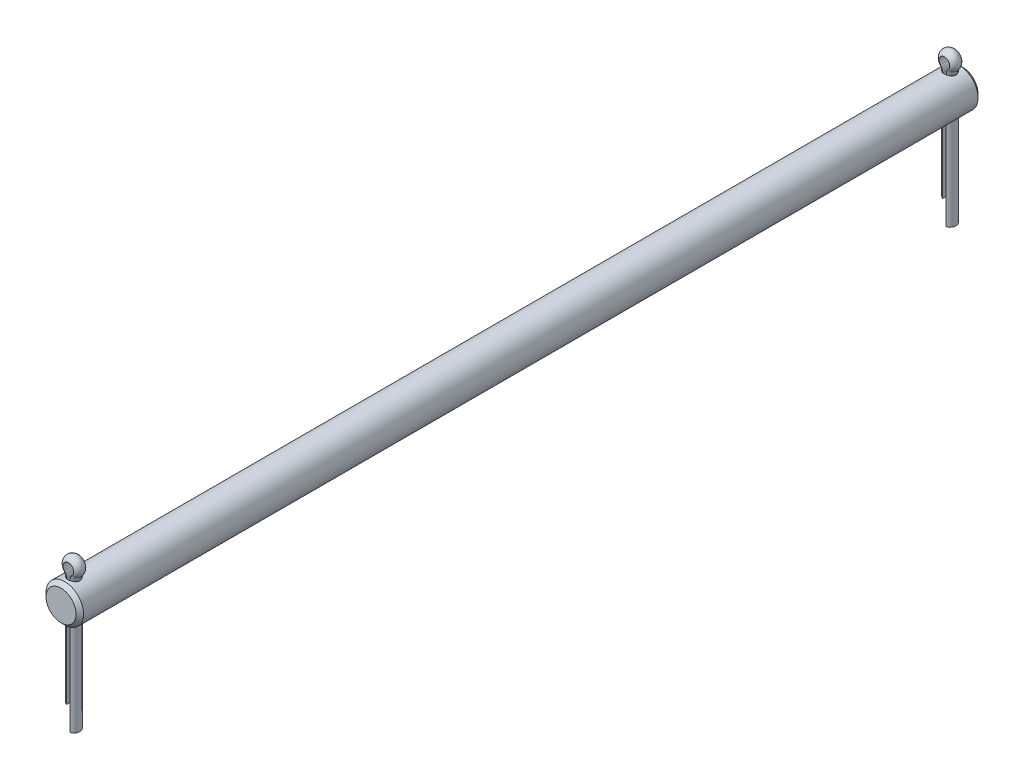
from build123d import *

# Parameters (mm, degrees)
SKETCH2_R           = 6.35
EXTRUDE1_DEPTH      = 152.4
EXTRUDE2_DEPTH      = 153.664354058
EXTRUDE2_DEPTH_BACK = 153.664354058
SKETCH3_R           = 1.984375
CHAMFER1_SIZE       = 1.27


with BuildPart() as part:
    # Sketch2 → Extrude1 (new, symmetric)
    with BuildSketch(Plane.XY):
        with Locations(Location((0, 0, 0), (0, 0, 180))):
            Circle(SKETCH2_R)
    extrude(amount=EXTRUDE1_DEPTH, both=True)

    # Sketch3 → Extrude2 (cut, two sides: drawn at the far end of the back side and taken through both)
    with BuildSketch(Plane(origin=(0, 0, 0), x_dir=(1, 0, 0), z_dir=(0, 1, 0)).offset(-EXTRUDE2_DEPTH_BACK)):
        with Locations(Location((0, -148.034375, 0), (0, 0, 270))):
            Circle(SKETCH3_R)
        with Locations(Location((0, 148.034375, 0), (0, 0, 270))):
            Circle(SKETCH3_R)
    extrude(amount=EXTRUDE2_DEPTH + EXTRUDE2_DEPTH_BACK, mode=Mode.SUBTRACT)

    # Chamfer1
    chamfer1_edges = [part.edges().sort_by_distance(p)[0] for p in [
        (6.35, 0, -152.4),
        (6.35, 0, 152.4),
    ]]
    chamfer(chamfer1_edges, length=CHAMFER1_SIZE)


with BuildPart() as body_2:
    # Sweep1: sweep along a path in Sketch4
    with BuildLine(Plane.XY.offset(148.034375)) as sweep1_path:
        Line((1.984375, -38.124902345), (1.984375, 6.35))
        ThreePointArc((1.984375, 6.35), (2.086904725, 6.911266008), (2.38125, 7.400032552))
        ThreePointArc((2.38125, 7.400032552), (0, 12.675097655), (-2.38125, 7.400032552))
        ThreePointArc((-2.38125, 7.400032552), (-2.086904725, 6.911266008), (-1.984375, 6.35))
        Line((-1.984375, 6.35), (-1.984375, -30.504902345))
    # Sketch5 → Sweep1 (sweep)
    with BuildSketch(Plane(origin=(1.984375, -38.124902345, 148.034375), x_dir=(-1, 0, 0), z_dir=(0, 1, 0))):
        with BuildLine():
            Line((1.3890625, 1.892973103), (1.3890625, -1.892973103))
            ThreePointArc((1.3890625, -1.892973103), (0, 0), (1.3890625, 1.892973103))
        make_face()
    sweep(path=sweep1_path.line)


with BuildPart() as body_3:
    # Mirror1: mirrored copy
    add(body_2.part.mirror(Plane.XY))


solid = Compound([part.part, body_2.part, body_3.part])
